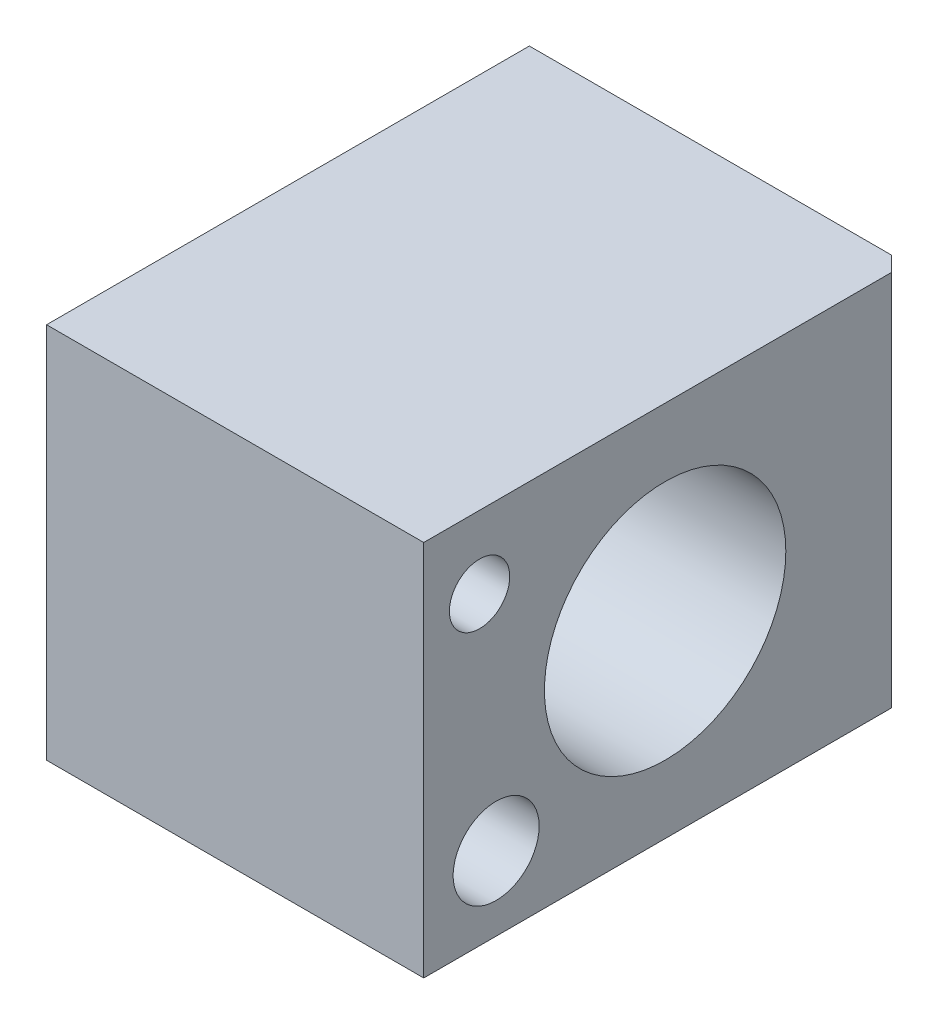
from build123d import *

# Parameters (mm, degrees)
ESQUISSE1_W             = 32
ESQUISSE1_H             = 25
BASE_EXTRUSION_DEPTH    = 12.5
ENL_V_MAT_EXTRU_1_REACH = 34.206
ESQUISSE2_R             = 8
ESQUISSE2_R_2           = 2.85
ESQUISSE2_R_3           = 2
CHANFREIN1_SIZE         = 1


with BuildPart() as part:
    # Esquisse1 → Base-Extrusion (new, symmetric)
    with BuildSketch(Plane(origin=(0, 0, 0), x_dir=(0, 0, -1), z_dir=(1, 0, 0))):
        Rectangle(ESQUISSE1_W, ESQUISSE1_H)
    extrude(amount=BASE_EXTRUSION_DEPTH, both=True)

    # Esquisse2 → Enl_v. mat.-Extru.1 (cut, up to next)
    with BuildSketch(Plane(origin=(12.5, 0, 0), x_dir=(0, 0, -1), z_dir=(1, 0, 0)), mode=Mode.PRIVATE) as enl_v_mat_extru_1_sk1:
        Circle(ESQUISSE2_R)
    enl_v_mat_extru_1_tool1 = extrude(enl_v_mat_extru_1_sk1.sketch, amount=-ENL_V_MAT_EXTRU_1_REACH, mode=Mode.PRIVATE) & part.part
    # Esquisse2 → Enl_v. mat.-Extru.1 (cut, up to next)
    with BuildSketch(Plane(origin=(12.5, 0, 0), x_dir=(0, 0, -1), z_dir=(1, 0, 0)), mode=Mode.PRIVATE) as enl_v_mat_extru_1_sk2:
        with Locations((-11.2, -7.6)):
            Circle(ESQUISSE2_R_2)
    enl_v_mat_extru_1_tool2 = extrude(enl_v_mat_extru_1_sk2.sketch, amount=-ENL_V_MAT_EXTRU_1_REACH, mode=Mode.PRIVATE) & part.part
    # Esquisse2 → Enl_v. mat.-Extru.1 (cut, up to next)
    with BuildSketch(Plane(origin=(12.5, 0, 0), x_dir=(0, 0, -1), z_dir=(1, 0, 0)), mode=Mode.PRIVATE) as enl_v_mat_extru_1_sk3:
        with Locations((-12.3, 7.7)):
            Circle(ESQUISSE2_R_3)
    enl_v_mat_extru_1_tool3 = extrude(enl_v_mat_extru_1_sk3.sketch, amount=-ENL_V_MAT_EXTRU_1_REACH, mode=Mode.PRIVATE) & part.part
    add(enl_v_mat_extru_1_tool1.solids().sort_by_distance((12.5, 0, 0))[0], mode=Mode.SUBTRACT)
    add(enl_v_mat_extru_1_tool2.solids().sort_by_distance((12.5, -7.6, 11.2))[0], mode=Mode.SUBTRACT)
    add(enl_v_mat_extru_1_tool3.solids().sort_by_distance((12.5, 7.7, 12.3))[0], mode=Mode.SUBTRACT)

    # Chanfrein1
    chanfrein1_edges = [part.edges().sort_by_distance(p)[0] for p in [
        (12.5, 0, -16),
    ]]
    chamfer(chanfrein1_edges, length=CHANFREIN1_SIZE)


solid = part.part
